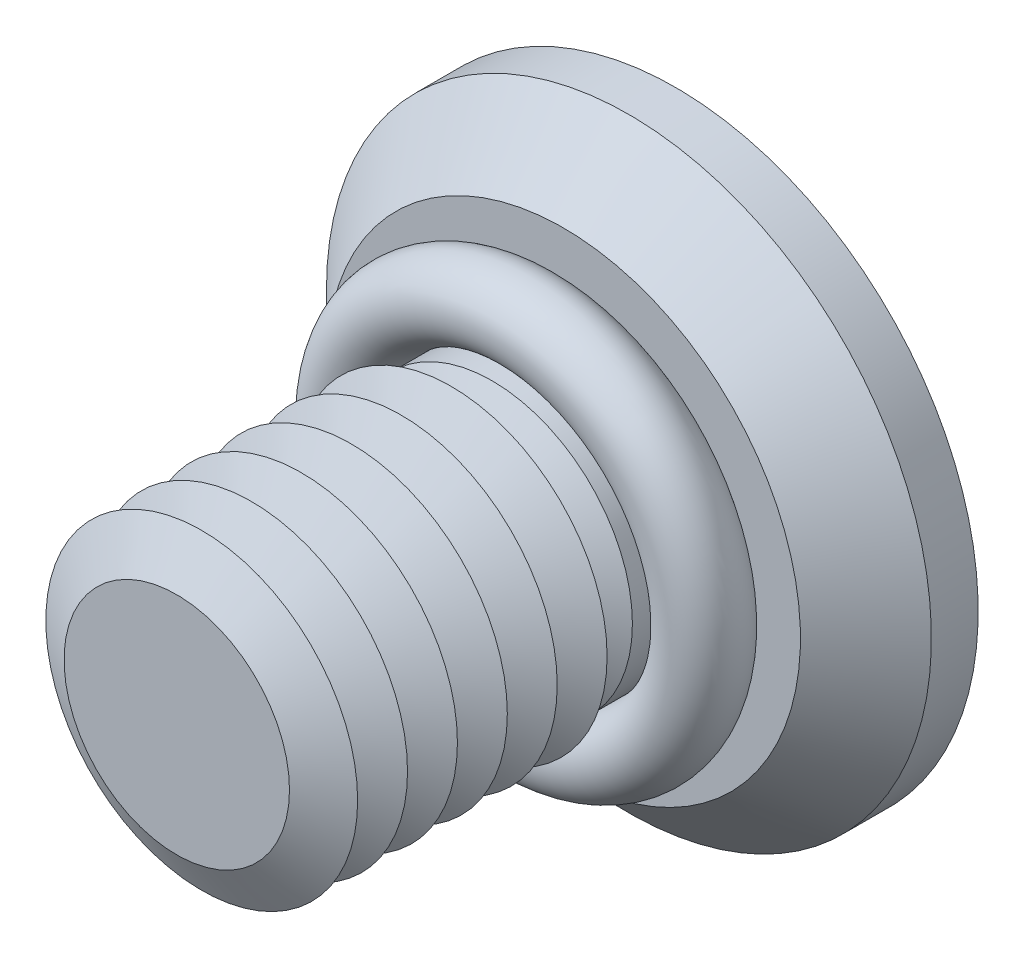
ISO-10303-21;
HEADER;
FILE_DESCRIPTION(('STEP AP214'),'2;1');
FILE_NAME('part.step','',(''),(''),'','','');
FILE_SCHEMA(('AUTOMOTIVE_DESIGN { 1 0 10303 214 1 1 1 1 }'));
ENDSEC;
DATA;
#1=APPLICATION_CONTEXT('core data for automotive mechanical design processes');
#2=APPLICATION_PROTOCOL_DEFINITION('international standard','automotive_design',2000,#1);
#3=PRODUCT_CONTEXT('',#1,'mechanical');
#4=PRODUCT('Part','Part','',(#3));
#5=PRODUCT_RELATED_PRODUCT_CATEGORY('part','',(#4));
#6=PRODUCT_DEFINITION_FORMATION('','',#4);
#7=PRODUCT_DEFINITION_CONTEXT('part definition',#1,'design');
#8=PRODUCT_DEFINITION('design','',#6,#7);
#9=PRODUCT_DEFINITION_SHAPE('','',#8);
#10=(LENGTH_UNIT() NAMED_UNIT(*) SI_UNIT(.MILLI.,.METRE.));
#11=(NAMED_UNIT(*) PLANE_ANGLE_UNIT() SI_UNIT($,.RADIAN.));
#12=(NAMED_UNIT(*) SI_UNIT($,.STERADIAN.) SOLID_ANGLE_UNIT());
#13=UNCERTAINTY_MEASURE_WITH_UNIT(LENGTH_MEASURE(1.E-05),#10,'distance_accuracy_value','');
#14=(GEOMETRIC_REPRESENTATION_CONTEXT(3) GLOBAL_UNCERTAINTY_ASSIGNED_CONTEXT((#13)) GLOBAL_UNIT_ASSIGNED_CONTEXT((#10,
#11,#12)) REPRESENTATION_CONTEXT('',''));
#15=CARTESIAN_POINT('',(0.,0.,0.));
#16=DIRECTION('',(0.,0.,1.));
#17=DIRECTION('',(1.,0.,0.));
#18=AXIS2_PLACEMENT_3D('',#15,#16,#17);
#19=CARTESIAN_POINT('',(0.,0.,2.4));
#20=DIRECTION('',(0.,0.,1.));
#21=DIRECTION('',(1.,0.,0.));
#22=AXIS2_PLACEMENT_3D('',#19,#20,#21);
#23=TOROIDAL_SURFACE('',#22,2.85,0.6);
#24=CARTESIAN_POINT('',(0.,2.85,2.4));
#25=DIRECTION('',(1.,0.,0.));
#26=DIRECTION('',(0.,0.,-1.));
#27=AXIS2_PLACEMENT_3D('',#24,#25,#26);
#28=CIRCLE('',#27,0.6);
#29=CARTESIAN_POINT('',(0.,3.45,2.4));
#30=VERTEX_POINT('',#29);
#31=EDGE_CURVE('P0_E10',#30,#30,#28,.T.);
#32=CARTESIAN_POINT('',(0.,0.,2.4));
#33=DIRECTION('',(0.,0.,1.));
#34=DIRECTION('',(1.,0.,0.));
#35=AXIS2_PLACEMENT_3D('',#32,#33,#34);
#36=CIRCLE('',#35,3.45);
#37=EDGE_CURVE('',#30,#30,#36,.T.);
#38=ORIENTED_EDGE('',*,*,#31,.F.);
#39=ORIENTED_EDGE('',*,*,#31,.T.);
#40=ORIENTED_EDGE('',*,*,#37,.T.);
#41=ORIENTED_EDGE('',*,*,#37,.F.);
#42=EDGE_LOOP('',(#38,#40,#39,#41));
#43=FACE_BOUND('',#42,.T.);
#44=ADVANCED_FACE('P0_F14',(#43),#23,.T.);
#45=CLOSED_SHELL('',(#44));
#46=MANIFOLD_SOLID_BREP('P0_B1',#45);
#47=CARTESIAN_POINT('',(0.,0.,4.));
#48=DIRECTION('',(0.,0.,-1.));
#49=DIRECTION('',(-1.,0.,0.));
#50=AXIS2_PLACEMENT_3D('',#47,#48,#49);
#51=CONICAL_SURFACE('',#50,1.80717967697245,1.0471975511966);
#52=CARTESIAN_POINT('',(0.,0.,3.6));
#53=DIRECTION('',(0.,0.,1.));
#54=DIRECTION('',(1.,0.,0.));
#55=AXIS2_PLACEMENT_3D('',#52,#53,#54);
#56=CIRCLE('',#55,2.5);
#57=CARTESIAN_POINT('',(2.5,0.,3.6));
#58=VERTEX_POINT('',#57);
#59=EDGE_CURVE('P1_E324',#58,#58,#56,.T.);
#60=ORIENTED_EDGE('',*,*,#59,.T.);
#61=EDGE_LOOP('',(#60));
#62=FACE_BOUND('',#61,.T.);
#63=CARTESIAN_POINT('',(0.,0.,4.));
#64=DIRECTION('',(0.,0.,1.));
#65=DIRECTION('',(1.,0.,0.));
#66=AXIS2_PLACEMENT_3D('',#63,#64,#65);
#67=CIRCLE('',#66,1.80717967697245);
#68=CARTESIAN_POINT('',(1.80717967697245,0.,4.));
#69=VERTEX_POINT('',#68);
#70=EDGE_CURVE('P1_E321',#69,#69,#67,.T.);
#71=ORIENTED_EDGE('',*,*,#70,.F.);
#72=EDGE_LOOP('',(#71));
#73=FACE_BOUND('',#72,.T.);
#74=ADVANCED_FACE('P1_F15',(#62,#73),#51,.T.);
#75=CARTESIAN_POINT('',(0.,0.,4.4));
#76=DIRECTION('',(0.,0.,1.));
#77=DIRECTION('',(1.,0.,0.));
#78=AXIS2_PLACEMENT_3D('',#75,#76,#77);
#79=CONICAL_SURFACE('',#78,2.5,1.0471975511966);
#80=ORIENTED_EDGE('',*,*,#70,.T.);
#81=EDGE_LOOP('',(#80));
#82=FACE_BOUND('',#81,.T.);
#83=CARTESIAN_POINT('',(0.,0.,4.4));
#84=DIRECTION('',(0.,0.,1.));
#85=DIRECTION('',(1.,0.,0.));
#86=AXIS2_PLACEMENT_3D('',#83,#84,#85);
#87=CIRCLE('',#86,2.5);
#88=CARTESIAN_POINT('',(2.5,0.,4.4));
#89=VERTEX_POINT('',#88);
#90=EDGE_CURVE('P1_E318',#89,#89,#87,.T.);
#91=ORIENTED_EDGE('',*,*,#90,.F.);
#92=EDGE_LOOP('',(#91));
#93=FACE_BOUND('',#92,.T.);
#94=ADVANCED_FACE('P1_F245',(#82,#93),#79,.T.);
#95=CARTESIAN_POINT('',(0.,0.,8.));
#96=DIRECTION('',(0.,0.,1.));
#97=DIRECTION('',(1.,0.,0.));
#98=AXIS2_PLACEMENT_3D('',#95,#96,#97);
#99=PLANE('',#98);
#100=CARTESIAN_POINT('',(0.,0.,8.));
#101=DIRECTION('',(0.,0.,1.));
#102=DIRECTION('',(1.,0.,0.));
#103=AXIS2_PLACEMENT_3D('',#100,#101,#102);
#104=CIRCLE('',#103,1.80717967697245);
#105=CARTESIAN_POINT('',(1.80717967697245,0.,8.));
#106=VERTEX_POINT('',#105);
#107=EDGE_CURVE('P1_E131',#106,#106,#104,.T.);
#108=ORIENTED_EDGE('',*,*,#107,.T.);
#109=EDGE_LOOP('',(#108));
#110=FACE_BOUND('',#109,.T.);
#111=ADVANCED_FACE('P1_F251',(#110),#99,.T.);
#112=CARTESIAN_POINT('',(0.,0.,8.));
#113=DIRECTION('',(0.,0.,-1.));
#114=DIRECTION('',(-1.,0.,0.));
#115=AXIS2_PLACEMENT_3D('',#112,#113,#114);
#116=CONICAL_SURFACE('',#115,1.80717967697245,1.0471975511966);
#117=CARTESIAN_POINT('',(0.,0.,7.6));
#118=DIRECTION('',(0.,0.,1.));
#119=DIRECTION('',(1.,0.,0.));
#120=AXIS2_PLACEMENT_3D('',#117,#118,#119);
#121=CIRCLE('',#120,2.5);
#122=CARTESIAN_POINT('',(2.5,0.,7.6));
#123=VERTEX_POINT('',#122);
#124=EDGE_CURVE('P1_E133',#123,#123,#121,.T.);
#125=ORIENTED_EDGE('',*,*,#124,.T.);
#126=EDGE_LOOP('',(#125));
#127=FACE_BOUND('',#126,.T.);
#128=ORIENTED_EDGE('',*,*,#107,.F.);
#129=EDGE_LOOP('',(#128));
#130=FACE_BOUND('',#129,.T.);
#131=ADVANCED_FACE('P1_F196',(#127,#130),#116,.T.);
#132=CARTESIAN_POINT('',(0.,0.,7.6));
#133=DIRECTION('',(0.,0.,1.));
#134=DIRECTION('',(1.,0.,0.));
#135=AXIS2_PLACEMENT_3D('',#132,#133,#134);
#136=CONICAL_SURFACE('',#135,2.5,1.0471975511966);
#137=CARTESIAN_POINT('',(0.,0.,7.2));
#138=DIRECTION('',(0.,0.,1.));
#139=DIRECTION('',(1.,0.,0.));
#140=AXIS2_PLACEMENT_3D('',#137,#138,#139);
#141=CIRCLE('',#140,1.80717967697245);
#142=CARTESIAN_POINT('',(1.80717967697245,0.,7.2));
#143=VERTEX_POINT('',#142);
#144=EDGE_CURVE('P1_E297',#143,#143,#141,.T.);
#145=ORIENTED_EDGE('',*,*,#144,.T.);
#146=EDGE_LOOP('',(#145));
#147=FACE_BOUND('',#146,.T.);
#148=ORIENTED_EDGE('',*,*,#124,.F.);
#149=EDGE_LOOP('',(#148));
#150=FACE_BOUND('',#149,.T.);
#151=ADVANCED_FACE('P1_F284',(#147,#150),#136,.T.);
#152=CARTESIAN_POINT('',(0.,0.,7.2));
#153=DIRECTION('',(0.,0.,-1.));
#154=DIRECTION('',(-1.,0.,0.));
#155=AXIS2_PLACEMENT_3D('',#152,#153,#154);
#156=CONICAL_SURFACE('',#155,1.80717967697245,1.0471975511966);
#157=CARTESIAN_POINT('',(0.,0.,6.8));
#158=DIRECTION('',(0.,0.,1.));
#159=DIRECTION('',(1.,0.,0.));
#160=AXIS2_PLACEMENT_3D('',#157,#158,#159);
#161=CIRCLE('',#160,2.5);
#162=CARTESIAN_POINT('',(2.5,0.,6.8));
#163=VERTEX_POINT('',#162);
#164=EDGE_CURVE('P1_E294',#163,#163,#161,.T.);
#165=ORIENTED_EDGE('',*,*,#164,.T.);
#166=EDGE_LOOP('',(#165));
#167=FACE_BOUND('',#166,.T.);
#168=ORIENTED_EDGE('',*,*,#144,.F.);
#169=EDGE_LOOP('',(#168));
#170=FACE_BOUND('',#169,.T.);
#171=ADVANCED_FACE('P1_F279',(#167,#170),#156,.T.);
#172=CARTESIAN_POINT('',(0.,0.,6.8));
#173=DIRECTION('',(0.,0.,1.));
#174=DIRECTION('',(1.,0.,0.));
#175=AXIS2_PLACEMENT_3D('',#172,#173,#174);
#176=CONICAL_SURFACE('',#175,2.5,1.0471975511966);
#177=CARTESIAN_POINT('',(0.,0.,6.4));
#178=DIRECTION('',(0.,0.,1.));
#179=DIRECTION('',(1.,0.,0.));
#180=AXIS2_PLACEMENT_3D('',#177,#178,#179);
#181=CIRCLE('',#180,1.80717967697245);
#182=CARTESIAN_POINT('',(1.80717967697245,0.,6.4));
#183=VERTEX_POINT('',#182);
#184=EDGE_CURVE('P1_E301',#183,#183,#181,.T.);
#185=ORIENTED_EDGE('',*,*,#184,.T.);
#186=EDGE_LOOP('',(#185));
#187=FACE_BOUND('',#186,.T.);
#188=ORIENTED_EDGE('',*,*,#164,.F.);
#189=EDGE_LOOP('',(#188));
#190=FACE_BOUND('',#189,.T.);
#191=ADVANCED_FACE('P1_F276',(#187,#190),#176,.T.);
#192=CARTESIAN_POINT('',(0.,0.,6.4));
#193=DIRECTION('',(0.,0.,-1.));
#194=DIRECTION('',(-1.,0.,0.));
#195=AXIS2_PLACEMENT_3D('',#192,#193,#194);
#196=CONICAL_SURFACE('',#195,1.80717967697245,1.0471975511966);
#197=CARTESIAN_POINT('',(0.,0.,6.));
#198=DIRECTION('',(0.,0.,1.));
#199=DIRECTION('',(1.,0.,0.));
#200=AXIS2_PLACEMENT_3D('',#197,#198,#199);
#201=CIRCLE('',#200,2.5);
#202=CARTESIAN_POINT('',(2.5,0.,6.));
#203=VERTEX_POINT('',#202);
#204=EDGE_CURVE('P1_E306',#203,#203,#201,.T.);
#205=ORIENTED_EDGE('',*,*,#204,.T.);
#206=EDGE_LOOP('',(#205));
#207=FACE_BOUND('',#206,.T.);
#208=ORIENTED_EDGE('',*,*,#184,.F.);
#209=EDGE_LOOP('',(#208));
#210=FACE_BOUND('',#209,.T.);
#211=ADVANCED_FACE('P1_F271',(#207,#210),#196,.T.);
#212=CARTESIAN_POINT('',(0.,0.,6.));
#213=DIRECTION('',(0.,0.,1.));
#214=DIRECTION('',(1.,0.,0.));
#215=AXIS2_PLACEMENT_3D('',#212,#213,#214);
#216=CONICAL_SURFACE('',#215,2.5,1.0471975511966);
#217=CARTESIAN_POINT('',(0.,0.,5.6));
#218=DIRECTION('',(0.,0.,1.));
#219=DIRECTION('',(1.,0.,0.));
#220=AXIS2_PLACEMENT_3D('',#217,#218,#219);
#221=CIRCLE('',#220,1.80717967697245);
#222=CARTESIAN_POINT('',(1.80717967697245,0.,5.6));
#223=VERTEX_POINT('',#222);
#224=EDGE_CURVE('P1_E309',#223,#223,#221,.T.);
#225=ORIENTED_EDGE('',*,*,#224,.T.);
#226=EDGE_LOOP('',(#225));
#227=FACE_BOUND('',#226,.T.);
#228=ORIENTED_EDGE('',*,*,#204,.F.);
#229=EDGE_LOOP('',(#228));
#230=FACE_BOUND('',#229,.T.);
#231=ADVANCED_FACE('P1_F268',(#227,#230),#216,.T.);
#232=CARTESIAN_POINT('',(0.,0.,5.6));
#233=DIRECTION('',(0.,0.,-1.));
#234=DIRECTION('',(-1.,0.,0.));
#235=AXIS2_PLACEMENT_3D('',#232,#233,#234);
#236=CONICAL_SURFACE('',#235,1.80717967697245,1.0471975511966);
#237=CARTESIAN_POINT('',(0.,0.,5.2));
#238=DIRECTION('',(0.,0.,1.));
#239=DIRECTION('',(1.,0.,0.));
#240=AXIS2_PLACEMENT_3D('',#237,#238,#239);
#241=CIRCLE('',#240,2.5);
#242=CARTESIAN_POINT('',(2.5,0.,5.2));
#243=VERTEX_POINT('',#242);
#244=EDGE_CURVE('P1_E312',#243,#243,#241,.T.);
#245=ORIENTED_EDGE('',*,*,#244,.T.);
#246=EDGE_LOOP('',(#245));
#247=FACE_BOUND('',#246,.T.);
#248=ORIENTED_EDGE('',*,*,#224,.F.);
#249=EDGE_LOOP('',(#248));
#250=FACE_BOUND('',#249,.T.);
#251=ADVANCED_FACE('P1_F262',(#247,#250),#236,.T.);
#252=CARTESIAN_POINT('',(0.,0.,5.2));
#253=DIRECTION('',(0.,0.,1.));
#254=DIRECTION('',(1.,0.,0.));
#255=AXIS2_PLACEMENT_3D('',#252,#253,#254);
#256=CONICAL_SURFACE('',#255,2.5,1.0471975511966);
#257=CARTESIAN_POINT('',(0.,0.,4.8));
#258=DIRECTION('',(0.,0.,1.));
#259=DIRECTION('',(1.,0.,0.));
#260=AXIS2_PLACEMENT_3D('',#257,#258,#259);
#261=CIRCLE('',#260,1.80717967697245);
#262=CARTESIAN_POINT('',(1.80717967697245,0.,4.8));
#263=VERTEX_POINT('',#262);
#264=EDGE_CURVE('P1_E315',#263,#263,#261,.T.);
#265=ORIENTED_EDGE('',*,*,#264,.T.);
#266=EDGE_LOOP('',(#265));
#267=FACE_BOUND('',#266,.T.);
#268=ORIENTED_EDGE('',*,*,#244,.F.);
#269=EDGE_LOOP('',(#268));
#270=FACE_BOUND('',#269,.T.);
#271=ADVANCED_FACE('P1_F258',(#267,#270),#256,.T.);
#272=CARTESIAN_POINT('',(0.,0.,4.8));
#273=DIRECTION('',(0.,0.,-1.));
#274=DIRECTION('',(-1.,0.,0.));
#275=AXIS2_PLACEMENT_3D('',#272,#273,#274);
#276=CONICAL_SURFACE('',#275,1.80717967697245,1.0471975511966);
#277=ORIENTED_EDGE('',*,*,#90,.T.);
#278=EDGE_LOOP('',(#277));
#279=FACE_BOUND('',#278,.T.);
#280=ORIENTED_EDGE('',*,*,#264,.F.);
#281=EDGE_LOOP('',(#280));
#282=FACE_BOUND('',#281,.T.);
#283=ADVANCED_FACE('P1_F261',(#279,#282),#276,.T.);
#284=CARTESIAN_POINT('',(0.,0.,3.2));
#285=DIRECTION('',(0.,0.,-1.));
#286=DIRECTION('',(-1.,0.,0.));
#287=AXIS2_PLACEMENT_3D('',#284,#285,#286);
#288=CONICAL_SURFACE('',#287,1.80717967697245,1.0471975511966);
#289=CARTESIAN_POINT('',(0.,0.,3.2));
#290=DIRECTION('',(0.,0.,1.));
#291=DIRECTION('',(1.,0.,0.));
#292=AXIS2_PLACEMENT_3D('',#289,#290,#291);
#293=CIRCLE('',#292,1.80717967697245);
#294=CARTESIAN_POINT('',(1.80717967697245,0.,3.2));
#295=VERTEX_POINT('',#294);
#296=EDGE_CURVE('P1_E326',#295,#295,#293,.T.);
#297=ORIENTED_EDGE('',*,*,#296,.F.);
#298=EDGE_LOOP('',(#297));
#299=FACE_BOUND('',#298,.T.);
#300=CARTESIAN_POINT('',(0.,0.,2.9443375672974));
#301=DIRECTION('',(0.,0.,-1.));
#302=DIRECTION('',(-1.,0.,0.));
#303=AXIS2_PLACEMENT_3D('',#300,#301,#302);
#304=CIRCLE('',#303,2.25);
#305=CARTESIAN_POINT('',(-2.25,0.,2.9443375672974));
#306=VERTEX_POINT('',#305);
#307=EDGE_CURVE('P1_E19',#306,#306,#304,.F.);
#308=ORIENTED_EDGE('',*,*,#307,.T.);
#309=EDGE_LOOP('',(#308));
#310=FACE_BOUND('',#309,.T.);
#311=ADVANCED_FACE('P1_F266',(#299,#310),#288,.T.);
#312=CARTESIAN_POINT('',(0.,0.,3.6));
#313=DIRECTION('',(0.,0.,1.));
#314=DIRECTION('',(1.,0.,0.));
#315=AXIS2_PLACEMENT_3D('',#312,#313,#314);
#316=CONICAL_SURFACE('',#315,2.5,1.0471975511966);
#317=ORIENTED_EDGE('',*,*,#296,.T.);
#318=EDGE_LOOP('',(#317));
#319=FACE_BOUND('',#318,.T.);
#320=ORIENTED_EDGE('',*,*,#59,.F.);
#321=EDGE_LOOP('',(#320));
#322=FACE_BOUND('',#321,.T.);
#323=ADVANCED_FACE('P1_F330',(#319,#322),#316,.T.);
#324=CARTESIAN_POINT('',(0.,0.,2.));
#325=DIRECTION('',(0.,0.,-1.));
#326=DIRECTION('',(-1.,0.,0.));
#327=AXIS2_PLACEMENT_3D('',#324,#325,#326);
#328=CONICAL_SURFACE('',#327,1.5,1.0471975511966);
#329=CARTESIAN_POINT('',(0.,0.,2.86602540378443));
#330=VERTEX_POINT('',#329);
#331=VERTEX_LOOP('',#330);
#332=FACE_BOUND('',#331,.T.);
#333=CARTESIAN_POINT('',(0.,0.,2.));
#334=DIRECTION('',(0.,0.,-1.));
#335=DIRECTION('',(-1.,0.,0.));
#336=AXIS2_PLACEMENT_3D('',#333,#334,#335);
#337=CIRCLE('',#336,1.5);
#338=CARTESIAN_POINT('',(-1.5,0.,2.));
#339=VERTEX_POINT('',#338);
#340=CARTESIAN_POINT('',(-0.75,1.29903810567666,2.));
#341=VERTEX_POINT('',#340);
#342=EDGE_CURVE('P1_E117',#339,#341,#337,.T.);
#343=ORIENTED_EDGE('',*,*,#342,.T.);
#344=CARTESIAN_POINT('',(0.,0.,2.));
#345=DIRECTION('',(0.,0.,-1.));
#346=DIRECTION('',(-1.,0.,0.));
#347=AXIS2_PLACEMENT_3D('',#344,#345,#346);
#348=CIRCLE('',#347,1.5);
#349=CARTESIAN_POINT('',(0.75,1.29903810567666,2.));
#350=VERTEX_POINT('',#349);
#351=EDGE_CURVE('P1_E24',#341,#350,#348,.T.);
#352=ORIENTED_EDGE('',*,*,#351,.T.);
#353=CARTESIAN_POINT('',(1.5,0.,2.));
#354=VERTEX_POINT('',#353);
#355=EDGE_CURVE('P1_E635',#350,#354,#348,.T.);
#356=ORIENTED_EDGE('',*,*,#355,.T.);
#357=CARTESIAN_POINT('',(0.750000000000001,-1.29903810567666,2.));
#358=VERTEX_POINT('',#357);
#359=EDGE_CURVE('P1_E628',#354,#358,#348,.T.);
#360=ORIENTED_EDGE('',*,*,#359,.T.);
#361=CARTESIAN_POINT('',(-0.75,-1.29903810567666,2.));
#362=VERTEX_POINT('',#361);
#363=EDGE_CURVE('P1_E182',#358,#362,#348,.T.);
#364=ORIENTED_EDGE('',*,*,#363,.T.);
#365=EDGE_CURVE('P1_E179',#362,#339,#348,.T.);
#366=ORIENTED_EDGE('',*,*,#365,.T.);
#367=EDGE_LOOP('',(#343,#352,#356,#360,#364,#366));
#368=FACE_BOUND('',#367,.T.);
#369=ADVANCED_FACE('P1_F198',(#332,#368),#328,.F.);
#370=CARTESIAN_POINT('',(0.,0.,2.));
#371=DIRECTION('',(0.,0.,-1.));
#372=DIRECTION('',(-1.,0.,0.));
#373=AXIS2_PLACEMENT_3D('',#370,#371,#372);
#374=PLANE('',#373);
#375=ORIENTED_EDGE('',*,*,#363,.F.);
#376=DIRECTION('',(-0.866025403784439,-0.5,0.));
#377=VECTOR('',#376,1.);
#378=CARTESIAN_POINT('',(1.5,-0.866025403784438,2.));
#379=LINE('',#378,#377);
#380=CARTESIAN_POINT('',(0.,-1.73205080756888,2.));
#381=VERTEX_POINT('',#380);
#382=EDGE_CURVE('P1_E644',#358,#381,#379,.T.);
#383=ORIENTED_EDGE('',*,*,#382,.T.);
#384=DIRECTION('',(-0.866025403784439,0.5,0.));
#385=VECTOR('',#384,1.);
#386=CARTESIAN_POINT('',(0.,-1.73205080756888,2.));
#387=LINE('',#386,#385);
#388=EDGE_CURVE('P1_E651',#381,#362,#387,.T.);
#389=ORIENTED_EDGE('',*,*,#388,.T.);
#390=EDGE_LOOP('',(#375,#383,#389));
#391=FACE_BOUND('',#390,.T.);
#392=ADVANCED_FACE('P1_F442',(#391),#374,.T.);
#393=ORIENTED_EDGE('',*,*,#365,.F.);
#394=CARTESIAN_POINT('',(-1.5,-0.86602540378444,2.));
#395=VERTEX_POINT('',#394);
#396=EDGE_CURVE('P1_E654',#362,#395,#387,.T.);
#397=ORIENTED_EDGE('',*,*,#396,.T.);
#398=DIRECTION('',(0.,1.,0.));
#399=VECTOR('',#398,1.);
#400=CARTESIAN_POINT('',(-1.5,-0.86602540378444,2.));
#401=LINE('',#400,#399);
#402=EDGE_CURVE('P1_E123',#395,#339,#401,.T.);
#403=ORIENTED_EDGE('',*,*,#402,.T.);
#404=EDGE_LOOP('',(#393,#397,#403));
#405=FACE_BOUND('',#404,.T.);
#406=ADVANCED_FACE('P1_F231',(#405),#374,.T.);
#407=ORIENTED_EDGE('',*,*,#342,.F.);
#408=CARTESIAN_POINT('',(-1.5,0.866025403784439,2.));
#409=VERTEX_POINT('',#408);
#410=EDGE_CURVE('P1_E656',#339,#409,#401,.T.);
#411=ORIENTED_EDGE('',*,*,#410,.T.);
#412=DIRECTION('',(0.866025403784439,0.5,0.));
#413=VECTOR('',#412,1.);
#414=CARTESIAN_POINT('',(-1.5,0.866025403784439,2.));
#415=LINE('',#414,#413);
#416=EDGE_CURVE('P1_E659',#409,#341,#415,.T.);
#417=ORIENTED_EDGE('',*,*,#416,.T.);
#418=EDGE_LOOP('',(#407,#411,#417));
#419=FACE_BOUND('',#418,.T.);
#420=ADVANCED_FACE('P1_F459',(#419),#374,.T.);
#421=ORIENTED_EDGE('',*,*,#351,.F.);
#422=CARTESIAN_POINT('',(0.,1.73205080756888,2.));
#423=VERTEX_POINT('',#422);
#424=EDGE_CURVE('P1_E658',#341,#423,#415,.T.);
#425=ORIENTED_EDGE('',*,*,#424,.T.);
#426=DIRECTION('',(0.866025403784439,-0.5,0.));
#427=VECTOR('',#426,1.);
#428=CARTESIAN_POINT('',(0.,1.73205080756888,2.));
#429=LINE('',#428,#427);
#430=EDGE_CURVE('P1_E161',#423,#350,#429,.T.);
#431=ORIENTED_EDGE('',*,*,#430,.T.);
#432=EDGE_LOOP('',(#421,#425,#431));
#433=FACE_BOUND('',#432,.T.);
#434=ADVANCED_FACE('P1_F468',(#433),#374,.T.);
#435=ORIENTED_EDGE('',*,*,#355,.F.);
#436=CARTESIAN_POINT('',(1.5,0.866025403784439,2.));
#437=VERTEX_POINT('',#436);
#438=EDGE_CURVE('P1_E643',#350,#437,#429,.T.);
#439=ORIENTED_EDGE('',*,*,#438,.T.);
#440=DIRECTION('',(0.,-1.,0.));
#441=VECTOR('',#440,1.);
#442=CARTESIAN_POINT('',(1.5,0.866025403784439,2.));
#443=LINE('',#442,#441);
#444=EDGE_CURVE('P1_E638',#437,#354,#443,.T.);
#445=ORIENTED_EDGE('',*,*,#444,.T.);
#446=EDGE_LOOP('',(#435,#439,#445));
#447=FACE_BOUND('',#446,.T.);
#448=ADVANCED_FACE('P1_F477',(#447),#374,.T.);
#449=ORIENTED_EDGE('',*,*,#359,.F.);
#450=CARTESIAN_POINT('',(1.5,-0.866025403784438,2.));
#451=VERTEX_POINT('',#450);
#452=EDGE_CURVE('P1_E630',#354,#451,#443,.T.);
#453=ORIENTED_EDGE('',*,*,#452,.T.);
#454=EDGE_CURVE('P1_E125',#451,#358,#379,.T.);
#455=ORIENTED_EDGE('',*,*,#454,.T.);
#456=EDGE_LOOP('',(#449,#453,#455));
#457=FACE_BOUND('',#456,.T.);
#458=ADVANCED_FACE('P1_F229',(#457),#374,.T.);
#459=CARTESIAN_POINT('',(1.5,-0.866025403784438,2.));
#460=DIRECTION('',(0.5,-0.866025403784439,0.));
#461=DIRECTION('',(0.866025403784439,0.5,0.));
#462=AXIS2_PLACEMENT_3D('',#459,#460,#461);
#463=PLANE('',#462);
#464=DIRECTION('',(0.,0.,-1.));
#465=VECTOR('',#464,1.);
#466=CARTESIAN_POINT('',(1.5,-0.866025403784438,2.));
#467=LINE('',#466,#465);
#468=CARTESIAN_POINT('',(1.5,-0.866025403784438,0.));
#469=VERTEX_POINT('',#468);
#470=EDGE_CURVE('P1_E164',#451,#469,#467,.T.);
#471=ORIENTED_EDGE('',*,*,#470,.T.);
#472=CARTESIAN_POINT('',(1.5002,-0.865909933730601,-3.09432014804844E-05));
#473=CARTESIAN_POINT('',(1.43789222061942,-0.901883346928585,0.00961367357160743));
#474=CARTESIAN_POINT('',(1.37547144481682,-0.937921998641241,0.0183695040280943));
#475=CARTESIAN_POINT('',(1.25040937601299,-1.01012661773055,0.0337528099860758));
#476=CARTESIAN_POINT('',(1.18776800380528,-1.04629263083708,0.0403794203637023));
#477=CARTESIAN_POINT('',(1.06264466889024,-1.11853262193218,0.0511173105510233));
#478=CARTESIAN_POINT('',(1.00016355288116,-1.15460611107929,0.0552413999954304));
#479=CARTESIAN_POINT('',(0.875121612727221,-1.22679910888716,0.0607713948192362));
#480=CARTESIAN_POINT('',(0.812560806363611,-1.26291860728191,0.0621778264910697));
#481=CARTESIAN_POINT('',(0.68743919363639,-1.33515760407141,0.0621778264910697));
#482=CARTESIAN_POINT('',(0.62487838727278,-1.37127710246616,0.0607713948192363));
#483=CARTESIAN_POINT('',(0.49983644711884,-1.44347010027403,0.0552413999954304));
#484=CARTESIAN_POINT('',(0.437355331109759,-1.47954358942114,0.0511173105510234));
#485=CARTESIAN_POINT('',(0.312231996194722,-1.55178358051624,0.0403794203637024));
#486=CARTESIAN_POINT('',(0.249590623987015,-1.58794959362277,0.0337528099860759));
#487=CARTESIAN_POINT('',(0.124528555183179,-1.66015421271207,0.0183695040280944));
#488=CARTESIAN_POINT('',(0.0621077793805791,-1.69619286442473,0.00961367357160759));
#489=CARTESIAN_POINT('',(-0.000199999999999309,-1.73216627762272,-3.09432014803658E-05));
#490=B_SPLINE_CURVE_WITH_KNOTS('',3,(#472,#473,#474,#475,#476,#477,#478,#479,#480,#481,#482,
#483,#484,#485,#486,#487,#488,#489),.UNSPECIFIED.,.F.,.F.,(4,2,2,2,2,2,2,2,4),(0.,
0.217782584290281,0.435653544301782,0.652399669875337,0.869103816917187,1.08580796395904,
1.30255408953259,1.52042504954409,1.73820763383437),.UNSPECIFIED.);
#491=CARTESIAN_POINT('',(0.,-1.73205080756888,0.));
#492=VERTEX_POINT('',#491);
#493=EDGE_CURVE('P1_E118',#469,#492,#490,.T.);
#494=ORIENTED_EDGE('',*,*,#493,.T.);
#495=DIRECTION('',(0.,0.,-1.));
#496=VECTOR('',#495,1.);
#497=CARTESIAN_POINT('',(0.,-1.73205080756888,2.));
#498=LINE('',#497,#496);
#499=EDGE_CURVE('P1_E116',#381,#492,#498,.T.);
#500=ORIENTED_EDGE('',*,*,#499,.F.);
#501=ORIENTED_EDGE('',*,*,#382,.F.);
#502=ORIENTED_EDGE('',*,*,#454,.F.);
#503=EDGE_LOOP('',(#471,#494,#500,#501,#502));
#504=FACE_BOUND('',#503,.T.);
#505=ADVANCED_FACE('P1_F226',(#504),#463,.F.);
#506=CARTESIAN_POINT('',(0.,-1.73205080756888,2.));
#507=DIRECTION('',(-0.5,-0.866025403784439,0.));
#508=DIRECTION('',(0.866025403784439,-0.5,0.));
#509=AXIS2_PLACEMENT_3D('',#506,#507,#508);
#510=PLANE('',#509);
#511=ORIENTED_EDGE('',*,*,#499,.T.);
#512=CARTESIAN_POINT('',(0.000200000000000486,-1.73216627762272,-3.09432014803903E-05));
#513=CARTESIAN_POINT('',(-0.0621077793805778,-1.69619286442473,0.00961367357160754));
#514=CARTESIAN_POINT('',(-0.124528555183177,-1.66015421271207,0.0183695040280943));
#515=CARTESIAN_POINT('',(-0.249590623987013,-1.58794959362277,0.0337528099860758));
#516=CARTESIAN_POINT('',(-0.312231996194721,-1.55178358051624,0.0403794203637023));
#517=CARTESIAN_POINT('',(-0.437355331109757,-1.47954358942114,0.0511173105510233));
#518=CARTESIAN_POINT('',(-0.499836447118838,-1.44347010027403,0.0552413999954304));
#519=CARTESIAN_POINT('',(-0.624878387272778,-1.37127710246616,0.0607713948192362));
#520=CARTESIAN_POINT('',(-0.687439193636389,-1.33515760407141,0.0621778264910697));
#521=CARTESIAN_POINT('',(-0.81256080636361,-1.26291860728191,0.0621778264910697));
#522=CARTESIAN_POINT('',(-0.87512161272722,-1.22679910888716,0.0607713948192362));
#523=CARTESIAN_POINT('',(-1.00016355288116,-1.15460611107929,0.0552413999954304));
#524=CARTESIAN_POINT('',(-1.06264466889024,-1.11853262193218,0.0511173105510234));
#525=CARTESIAN_POINT('',(-1.18776800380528,-1.04629263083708,0.0403794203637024));
#526=CARTESIAN_POINT('',(-1.25040937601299,-1.01012661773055,0.0337528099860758));
#527=CARTESIAN_POINT('',(-1.37547144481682,-0.937921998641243,0.0183695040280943));
#528=CARTESIAN_POINT('',(-1.43789222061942,-0.901883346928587,0.00961367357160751));
#529=CARTESIAN_POINT('',(-1.5002,-0.865909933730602,-3.09432014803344E-05));
#530=B_SPLINE_CURVE_WITH_KNOTS('',3,(#512,#513,#514,#515,#516,#517,#518,#519,#520,#521,#522,
#523,#524,#525,#526,#527,#528,#529),.UNSPECIFIED.,.F.,.F.,(4,2,2,2,2,2,2,2,4),(0.,
0.217782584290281,0.435653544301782,0.652399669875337,0.869103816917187,1.08580796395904,
1.30255408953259,1.52042504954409,1.73820763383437),.UNSPECIFIED.);
#531=CARTESIAN_POINT('',(-1.5,-0.86602540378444,0.));
#532=VERTEX_POINT('',#531);
#533=EDGE_CURVE('P1_E94',#492,#532,#530,.T.);
#534=ORIENTED_EDGE('',*,*,#533,.T.);
#535=DIRECTION('',(0.,0.,-1.));
#536=VECTOR('',#535,1.);
#537=CARTESIAN_POINT('',(-1.5,-0.86602540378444,2.));
#538=LINE('',#537,#536);
#539=EDGE_CURVE('P1_E112',#395,#532,#538,.T.);
#540=ORIENTED_EDGE('',*,*,#539,.F.);
#541=ORIENTED_EDGE('',*,*,#396,.F.);
#542=ORIENTED_EDGE('',*,*,#388,.F.);
#543=EDGE_LOOP('',(#511,#534,#540,#541,#542));
#544=FACE_BOUND('',#543,.T.);
#545=ADVANCED_FACE('P1_F110',(#544),#510,.F.);
#546=CARTESIAN_POINT('',(-1.5,-0.86602540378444,2.));
#547=DIRECTION('',(-1.,0.,0.));
#548=DIRECTION('',(0.,-1.,0.));
#549=AXIS2_PLACEMENT_3D('',#546,#547,#548);
#550=PLANE('',#549);
#551=ORIENTED_EDGE('',*,*,#539,.T.);
#552=CARTESIAN_POINT('',(-1.5,-2.26080568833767,-0.262887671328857));
#553=CARTESIAN_POINT('',(-1.5,-2.19307335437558,-0.247767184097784));
#554=CARTESIAN_POINT('',(-1.5,-2.12529797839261,-0.232839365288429));
#555=CARTESIAN_POINT('',(-1.5,-1.989639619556,-0.203466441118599));
#556=CARTESIAN_POINT('',(-1.5,-1.92175663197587,-0.189021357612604));
#557=CARTESIAN_POINT('',(-1.5,-1.71778516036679,-0.146529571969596));
#558=CARTESIAN_POINT('',(-1.5,-1.58151166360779,-0.119357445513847));
#559=CARTESIAN_POINT('',(-1.5,-1.30947840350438,-0.0687885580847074));
#560=CARTESIAN_POINT('',(-1.5,-1.17372447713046,-0.0453610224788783));
#561=CARTESIAN_POINT('',(-1.5,-0.901404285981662,-0.0038503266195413));
#562=CARTESIAN_POINT('',(-1.5,-0.764838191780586,0.0142339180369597));
#563=CARTESIAN_POINT('',(-1.5,-0.489293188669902,0.0427079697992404));
#564=CARTESIAN_POINT('',(-1.5,-0.350304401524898,0.0530091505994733));
#565=CARTESIAN_POINT('',(-1.5,-0.141571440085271,0.0608183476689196));
#566=CARTESIAN_POINT('',(-1.5,-0.0719628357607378,0.0621480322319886));
#567=CARTESIAN_POINT('',(-1.5,0.0672555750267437,0.0622066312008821));
#568=CARTESIAN_POINT('',(-1.5,0.136865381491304,0.0609355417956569));
#569=CARTESIAN_POINT('',(-1.5,0.346114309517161,0.0532774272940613));
#570=CARTESIAN_POINT('',(-1.5,0.485619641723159,0.0430252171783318));
#571=CARTESIAN_POINT('',(-1.5,0.763829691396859,0.0143998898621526));
#572=CARTESIAN_POINT('',(-1.5,0.902533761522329,-0.0039790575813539));
#573=CARTESIAN_POINT('',(-1.5,1.18270277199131,-0.046775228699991));
#574=CARTESIAN_POINT('',(-1.5,1.32414472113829,-0.0713381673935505));
#575=CARTESIAN_POINT('',(-1.5,1.60634089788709,-0.124177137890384));
#576=CARTESIAN_POINT('',(-1.5,1.74709501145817,-0.152453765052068));
#577=CARTESIAN_POINT('',(-1.5,2.0281352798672,-0.21141289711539));
#578=CARTESIAN_POINT('',(-1.5,2.16842128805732,-0.242096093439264));
#579=CARTESIAN_POINT('',(-1.5,2.44863558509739,-0.305057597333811));
#580=CARTESIAN_POINT('',(-1.5,2.5885638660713,-0.337335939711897));
#581=CARTESIAN_POINT('',(-1.5,2.86645602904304,-0.402586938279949));
#582=CARTESIAN_POINT('',(-1.5,3.0044230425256,-0.435546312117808));
#583=CARTESIAN_POINT('',(-1.5,3.28017563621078,-0.502227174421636));
#584=CARTESIAN_POINT('',(-1.5,3.41796121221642,-0.535948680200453));
#585=CARTESIAN_POINT('',(-1.5,3.69320305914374,-0.603899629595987));
#586=CARTESIAN_POINT('',(-1.5,3.83065952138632,-0.638128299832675));
#587=CARTESIAN_POINT('',(-1.5,4.10546119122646,-0.707008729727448));
#588=CARTESIAN_POINT('',(-1.5,4.24280640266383,-0.741660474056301));
#589=CARTESIAN_POINT('',(-1.5,4.38011382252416,-0.776459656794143));
#590=B_SPLINE_CURVE_WITH_KNOTS('',3,(#552,#553,#554,#555,#556,#557,#558,#559,#560,#561,#562,
#563,#564,#565,#566,#567,#568,#569,#570,#571,#572,#573,#574,#575,#576,#577,#578,#579,#580,#581,
#582,#583,#584,#585,#586,#587,#588,#589),.UNSPECIFIED.,.F.,.F.,(4,2,2,2,2,2,2,2,2,2,2,2,2,2,2,2,
2,2,4),(0.,0.208198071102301,0.416405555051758,0.833243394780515,1.2464565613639,
1.65958581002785,2.07735129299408,2.28617008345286,2.49498917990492,2.91428402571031,
3.33388016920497,3.76448033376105,4.19514961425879,4.62594308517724,5.05674596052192,
5.48229088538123,5.90784548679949,6.33280701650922,6.75775319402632),.UNSPECIFIED.);
#591=CARTESIAN_POINT('',(-1.5,0.866025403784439,0.));
#592=VERTEX_POINT('',#591);
#593=EDGE_CURVE('P1_E10',#532,#592,#590,.T.);
#594=ORIENTED_EDGE('',*,*,#593,.T.);
#595=DIRECTION('',(0.,0.,-1.));
#596=VECTOR('',#595,1.);
#597=CARTESIAN_POINT('',(-1.5,0.866025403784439,2.));
#598=LINE('',#597,#596);
#599=EDGE_CURVE('P1_E124',#409,#592,#598,.T.);
#600=ORIENTED_EDGE('',*,*,#599,.F.);
#601=ORIENTED_EDGE('',*,*,#410,.F.);
#602=ORIENTED_EDGE('',*,*,#402,.F.);
#603=EDGE_LOOP('',(#551,#594,#600,#601,#602));
#604=FACE_BOUND('',#603,.T.);
#605=ADVANCED_FACE('P1_F120',(#604),#550,.F.);
#606=CARTESIAN_POINT('',(-1.5,0.866025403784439,2.));
#607=DIRECTION('',(-0.5,0.866025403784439,0.));
#608=DIRECTION('',(-0.866025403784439,-0.5,0.));
#609=AXIS2_PLACEMENT_3D('',#606,#607,#608);
#610=PLANE('',#609);
#611=ORIENTED_EDGE('',*,*,#599,.T.);
#612=CARTESIAN_POINT('',(-1.5002,0.865909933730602,-3.09432014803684E-05));
#613=CARTESIAN_POINT('',(-1.43789222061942,0.901883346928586,0.00961367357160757));
#614=CARTESIAN_POINT('',(-1.37547144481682,0.937921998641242,0.0183695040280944));
#615=CARTESIAN_POINT('',(-1.25040937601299,1.01012661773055,0.0337528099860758));
#616=CARTESIAN_POINT('',(-1.18776800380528,1.04629263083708,0.0403794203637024));
#617=CARTESIAN_POINT('',(-1.06264466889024,1.11853262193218,0.0511173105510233));
#618=CARTESIAN_POINT('',(-1.00016355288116,1.15460611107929,0.0552413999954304));
#619=CARTESIAN_POINT('',(-0.875121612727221,1.22679910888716,0.0607713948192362));
#620=CARTESIAN_POINT('',(-0.81256080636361,1.26291860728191,0.0621778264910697));
#621=CARTESIAN_POINT('',(-0.687439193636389,1.33515760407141,0.0621778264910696));
#622=CARTESIAN_POINT('',(-0.624878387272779,1.37127710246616,0.0607713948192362));
#623=CARTESIAN_POINT('',(-0.499836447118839,1.44347010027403,0.0552413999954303));
#624=CARTESIAN_POINT('',(-0.437355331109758,1.47954358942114,0.0511173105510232));
#625=CARTESIAN_POINT('',(-0.312231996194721,1.55178358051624,0.0403794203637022));
#626=CARTESIAN_POINT('',(-0.249590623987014,1.58794959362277,0.0337528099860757));
#627=CARTESIAN_POINT('',(-0.124528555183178,1.66015421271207,0.0183695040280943));
#628=CARTESIAN_POINT('',(-0.0621077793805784,1.69619286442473,0.00961367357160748));
#629=CARTESIAN_POINT('',(0.000199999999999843,1.73216627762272,-3.09432014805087E-05));
#630=B_SPLINE_CURVE_WITH_KNOTS('',3,(#612,#613,#614,#615,#616,#617,#618,#619,#620,#621,#622,
#623,#624,#625,#626,#627,#628,#629),.UNSPECIFIED.,.F.,.F.,(4,2,2,2,2,2,2,2,4),(0.,
0.217782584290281,0.435653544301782,0.652399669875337,0.869103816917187,1.08580796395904,
1.30255408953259,1.52042504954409,1.73820763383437),.UNSPECIFIED.);
#631=CARTESIAN_POINT('',(0.,1.73205080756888,0.));
#632=VERTEX_POINT('',#631);
#633=EDGE_CURVE('P1_E136',#592,#632,#630,.T.);
#634=ORIENTED_EDGE('',*,*,#633,.T.);
#635=DIRECTION('',(0.,0.,-1.));
#636=VECTOR('',#635,1.);
#637=CARTESIAN_POINT('',(0.,1.73205080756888,2.));
#638=LINE('',#637,#636);
#639=EDGE_CURVE('P1_E155',#423,#632,#638,.T.);
#640=ORIENTED_EDGE('',*,*,#639,.F.);
#641=ORIENTED_EDGE('',*,*,#424,.F.);
#642=ORIENTED_EDGE('',*,*,#416,.F.);
#643=EDGE_LOOP('',(#611,#634,#640,#641,#642));
#644=FACE_BOUND('',#643,.T.);
#645=ADVANCED_FACE('P1_F153',(#644),#610,.F.);
#646=CARTESIAN_POINT('',(0.,1.73205080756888,2.));
#647=DIRECTION('',(0.5,0.866025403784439,0.));
#648=DIRECTION('',(-0.866025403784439,0.5,0.));
#649=AXIS2_PLACEMENT_3D('',#646,#647,#648);
#650=PLANE('',#649);
#651=ORIENTED_EDGE('',*,*,#639,.T.);
#652=CARTESIAN_POINT('',(-0.00019999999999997,1.73216627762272,-3.09432014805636E-05));
#653=CARTESIAN_POINT('',(0.0621077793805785,1.69619286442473,0.00961367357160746));
#654=CARTESIAN_POINT('',(0.124528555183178,1.66015421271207,0.0183695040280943));
#655=CARTESIAN_POINT('',(0.249590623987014,1.58794959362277,0.0337528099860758));
#656=CARTESIAN_POINT('',(0.312231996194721,1.55178358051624,0.0403794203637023));
#657=CARTESIAN_POINT('',(0.437355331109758,1.47954358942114,0.0511173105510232));
#658=CARTESIAN_POINT('',(0.499836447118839,1.44347010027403,0.0552413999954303));
#659=CARTESIAN_POINT('',(0.624878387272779,1.37127710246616,0.0607713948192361));
#660=CARTESIAN_POINT('',(0.68743919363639,1.33515760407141,0.0621778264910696));
#661=CARTESIAN_POINT('',(0.812560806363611,1.26291860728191,0.0621778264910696));
#662=CARTESIAN_POINT('',(0.875121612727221,1.22679910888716,0.0607713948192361));
#663=CARTESIAN_POINT('',(1.00016355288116,1.15460611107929,0.0552413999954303));
#664=CARTESIAN_POINT('',(1.06264466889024,1.11853262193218,0.0511173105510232));
#665=CARTESIAN_POINT('',(1.18776800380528,1.04629263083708,0.0403794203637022));
#666=CARTESIAN_POINT('',(1.25040937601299,1.01012661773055,0.0337528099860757));
#667=CARTESIAN_POINT('',(1.37547144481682,0.937921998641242,0.0183695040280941));
#668=CARTESIAN_POINT('',(1.43789222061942,0.901883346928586,0.0096136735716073));
#669=CARTESIAN_POINT('',(1.5002,0.865909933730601,-3.09432014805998E-05));
#670=B_SPLINE_CURVE_WITH_KNOTS('',3,(#652,#653,#654,#655,#656,#657,#658,#659,#660,#661,#662,
#663,#664,#665,#666,#667,#668,#669),.UNSPECIFIED.,.F.,.F.,(4,2,2,2,2,2,2,2,4),(0.,
0.217782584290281,0.435653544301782,0.652399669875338,0.869103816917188,1.08580796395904,
1.30255408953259,1.52042504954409,1.73820763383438),.UNSPECIFIED.);
#671=CARTESIAN_POINT('',(1.5,0.866025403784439,0.));
#672=VERTEX_POINT('',#671);
#673=EDGE_CURVE('P1_E141',#632,#672,#670,.T.);
#674=ORIENTED_EDGE('',*,*,#673,.T.);
#675=DIRECTION('',(0.,0.,-1.));
#676=VECTOR('',#675,1.);
#677=CARTESIAN_POINT('',(1.5,0.866025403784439,2.));
#678=LINE('',#677,#676);
#679=EDGE_CURVE('P1_E162',#437,#672,#678,.T.);
#680=ORIENTED_EDGE('',*,*,#679,.F.);
#681=ORIENTED_EDGE('',*,*,#438,.F.);
#682=ORIENTED_EDGE('',*,*,#430,.F.);
#683=EDGE_LOOP('',(#651,#674,#680,#681,#682));
#684=FACE_BOUND('',#683,.T.);
#685=ADVANCED_FACE('P1_F158',(#684),#650,.F.);
#686=CARTESIAN_POINT('',(1.5,0.866025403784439,2.));
#687=DIRECTION('',(1.,0.,0.));
#688=DIRECTION('',(0.,0.,-1.));
#689=AXIS2_PLACEMENT_3D('',#686,#687,#688);
#690=PLANE('',#689);
#691=ORIENTED_EDGE('',*,*,#679,.T.);
#692=CARTESIAN_POINT('',(1.5,-2.26080568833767,-0.262887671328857));
#693=CARTESIAN_POINT('',(1.5,-2.19307335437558,-0.247767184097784));
#694=CARTESIAN_POINT('',(1.5,-2.12529797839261,-0.232839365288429));
#695=CARTESIAN_POINT('',(1.5,-1.989639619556,-0.203466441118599));
#696=CARTESIAN_POINT('',(1.5,-1.92175663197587,-0.189021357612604));
#697=CARTESIAN_POINT('',(1.5,-1.71778516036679,-0.146529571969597));
#698=CARTESIAN_POINT('',(1.5,-1.58151166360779,-0.119357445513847));
#699=CARTESIAN_POINT('',(1.5,-1.30947840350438,-0.0687885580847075));
#700=CARTESIAN_POINT('',(1.5,-1.17372447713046,-0.0453610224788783));
#701=CARTESIAN_POINT('',(1.5,-0.90140428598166,-0.0038503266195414));
#702=CARTESIAN_POINT('',(1.5,-0.764838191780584,0.0142339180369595));
#703=CARTESIAN_POINT('',(1.5,-0.489293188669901,0.0427079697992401));
#704=CARTESIAN_POINT('',(1.5,-0.350304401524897,0.053009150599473));
#705=CARTESIAN_POINT('',(1.5,-0.14157144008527,0.0608183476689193));
#706=CARTESIAN_POINT('',(1.5,-0.0719628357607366,0.0621480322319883));
#707=CARTESIAN_POINT('',(1.5,0.067255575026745,0.0622066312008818));
#708=CARTESIAN_POINT('',(1.5,0.136865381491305,0.0609355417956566));
#709=CARTESIAN_POINT('',(1.5,0.346114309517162,0.0532774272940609));
#710=CARTESIAN_POINT('',(1.5,0.48561964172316,0.0430252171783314));
#711=CARTESIAN_POINT('',(1.5,0.76382969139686,0.0143998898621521));
#712=CARTESIAN_POINT('',(1.5,0.902533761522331,-0.00397905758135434));
#713=CARTESIAN_POINT('',(1.5,1.18270277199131,-0.0467752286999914));
#714=CARTESIAN_POINT('',(1.5,1.32414472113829,-0.0713381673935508));
#715=CARTESIAN_POINT('',(1.5,1.60634089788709,-0.124177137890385));
#716=CARTESIAN_POINT('',(1.5,1.74709501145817,-0.152453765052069));
#717=CARTESIAN_POINT('',(1.5,2.02813527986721,-0.21141289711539));
#718=CARTESIAN_POINT('',(1.5,2.16842128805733,-0.242096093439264));
#719=CARTESIAN_POINT('',(1.5,2.44863558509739,-0.305057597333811));
#720=CARTESIAN_POINT('',(1.5,2.5885638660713,-0.337335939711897));
#721=CARTESIAN_POINT('',(1.5,2.86645602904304,-0.40258693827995));
#722=CARTESIAN_POINT('',(1.5,3.0044230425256,-0.435546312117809));
#723=CARTESIAN_POINT('',(1.5,3.28017563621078,-0.502227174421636));
#724=CARTESIAN_POINT('',(1.5,3.41796121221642,-0.535948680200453));
#725=CARTESIAN_POINT('',(1.5,3.69320305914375,-0.603899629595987));
#726=CARTESIAN_POINT('',(1.5,3.83065952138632,-0.638128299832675));
#727=CARTESIAN_POINT('',(1.5,4.10546119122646,-0.707008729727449));
#728=CARTESIAN_POINT('',(1.5,4.24280640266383,-0.741660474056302));
#729=CARTESIAN_POINT('',(1.5,4.38011382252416,-0.776459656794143));
#730=B_SPLINE_CURVE_WITH_KNOTS('',3,(#692,#693,#694,#695,#696,#697,#698,#699,#700,#701,#702,
#703,#704,#705,#706,#707,#708,#709,#710,#711,#712,#713,#714,#715,#716,#717,#718,#719,#720,#721,
#722,#723,#724,#725,#726,#727,#728,#729),.UNSPECIFIED.,.F.,.F.,(4,2,2,2,2,2,2,2,2,2,2,2,2,2,2,2,
2,2,4),(0.,0.208198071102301,0.416405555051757,0.833243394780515,1.2464565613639,
1.65958581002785,2.07735129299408,2.28617008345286,2.49498917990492,2.91428402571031,
3.33388016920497,3.76448033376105,4.19514961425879,4.62594308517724,5.05674596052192,
5.48229088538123,5.90784548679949,6.33280701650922,6.75775319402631),.UNSPECIFIED.);
#731=EDGE_CURVE('P1_E149',#672,#469,#730,.F.);
#732=ORIENTED_EDGE('',*,*,#731,.T.);
#733=ORIENTED_EDGE('',*,*,#470,.F.);
#734=ORIENTED_EDGE('',*,*,#452,.F.);
#735=ORIENTED_EDGE('',*,*,#444,.F.);
#736=EDGE_LOOP('',(#691,#732,#733,#734,#735));
#737=FACE_BOUND('',#736,.T.);
#738=ADVANCED_FACE('P1_F232',(#737),#690,.F.);
#739=CARTESIAN_POINT('',(0.,0.,0.));
#740=DIRECTION('',(0.,0.,-1.));
#741=DIRECTION('',(-1.,0.,0.));
#742=AXIS2_PLACEMENT_3D('',#739,#740,#741);
#743=CONICAL_SURFACE('',#742,1.73205080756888,1.30899693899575);
#744=CARTESIAN_POINT('',(0.,0.,0.));
#745=DIRECTION('',(0.,0.,-1.));
#746=DIRECTION('',(-1.,0.,0.));
#747=AXIS2_PLACEMENT_3D('',#744,#745,#746);
#748=CIRCLE('',#747,1.73205080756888);
#749=EDGE_CURVE('P1_E30',#469,#492,#748,.T.);
#750=ORIENTED_EDGE('',*,*,#749,.T.);
#751=ORIENTED_EDGE('',*,*,#493,.F.);
#752=EDGE_LOOP('',(#750,#751));
#753=FACE_BOUND('',#752,.T.);
#754=ADVANCED_FACE('P1_F195',(#753),#743,.F.);
#755=EDGE_CURVE('P1_E90',#492,#532,#748,.T.);
#756=ORIENTED_EDGE('',*,*,#755,.T.);
#757=ORIENTED_EDGE('',*,*,#533,.F.);
#758=EDGE_LOOP('',(#756,#757));
#759=FACE_BOUND('',#758,.T.);
#760=ADVANCED_FACE('P1_F92',(#759),#743,.F.);
#761=EDGE_CURVE('P1_E98',#532,#592,#748,.T.);
#762=ORIENTED_EDGE('',*,*,#761,.T.);
#763=ORIENTED_EDGE('',*,*,#593,.F.);
#764=EDGE_LOOP('',(#762,#763));
#765=FACE_BOUND('',#764,.T.);
#766=ADVANCED_FACE('P1_F102',(#765),#743,.F.);
#767=EDGE_CURVE('P1_E130',#592,#632,#748,.T.);
#768=ORIENTED_EDGE('',*,*,#767,.T.);
#769=ORIENTED_EDGE('',*,*,#633,.F.);
#770=EDGE_LOOP('',(#768,#769));
#771=FACE_BOUND('',#770,.T.);
#772=ADVANCED_FACE('P1_F551',(#771),#743,.F.);
#773=EDGE_CURVE('P1_E137',#632,#672,#748,.T.);
#774=ORIENTED_EDGE('',*,*,#773,.T.);
#775=ORIENTED_EDGE('',*,*,#673,.F.);
#776=EDGE_LOOP('',(#774,#775));
#777=FACE_BOUND('',#776,.T.);
#778=ADVANCED_FACE('P1_F144',(#777),#743,.F.);
#779=EDGE_CURVE('P1_E37',#672,#469,#748,.T.);
#780=ORIENTED_EDGE('',*,*,#779,.T.);
#781=ORIENTED_EDGE('',*,*,#731,.F.);
#782=EDGE_LOOP('',(#780,#781));
#783=FACE_BOUND('',#782,.T.);
#784=ADVANCED_FACE('P1_F537',(#783),#743,.F.);
#785=CARTESIAN_POINT('',(0.,0.,0.));
#786=DIRECTION('',(0.,0.,1.));
#787=DIRECTION('',(1.,0.,0.));
#788=AXIS2_PLACEMENT_3D('',#785,#786,#787);
#789=PLANE('',#788);
#790=ORIENTED_EDGE('',*,*,#779,.F.);
#791=ORIENTED_EDGE('',*,*,#773,.F.);
#792=ORIENTED_EDGE('',*,*,#767,.F.);
#793=ORIENTED_EDGE('',*,*,#761,.F.);
#794=ORIENTED_EDGE('',*,*,#755,.F.);
#795=ORIENTED_EDGE('',*,*,#749,.F.);
#796=EDGE_LOOP('',(#790,#791,#792,#793,#794,#795));
#797=FACE_BOUND('',#796,.T.);
#798=CARTESIAN_POINT('',(0.,0.,0.));
#799=DIRECTION('',(0.,0.,-1.));
#800=DIRECTION('',(-1.,0.,0.));
#801=AXIS2_PLACEMENT_3D('',#798,#799,#800);
#802=CIRCLE('',#801,4.85);
#803=CARTESIAN_POINT('',(-4.85,0.,0.));
#804=VERTEX_POINT('',#803);
#805=EDGE_CURVE('P1_E169',#804,#804,#802,.T.);
#806=ORIENTED_EDGE('',*,*,#805,.T.);
#807=EDGE_LOOP('',(#806));
#808=FACE_BOUND('',#807,.T.);
#809=ADVANCED_FACE('P1_F17',(#797,#808),#789,.F.);
#810=CARTESIAN_POINT('',(0.,0.,8.));
#811=DIRECTION('',(0.,0.,-1.));
#812=DIRECTION('',(-1.,0.,0.));
#813=AXIS2_PLACEMENT_3D('',#810,#811,#812);
#814=CYLINDRICAL_SURFACE('',#813,4.85);
#815=ORIENTED_EDGE('',*,*,#805,.F.);
#816=EDGE_LOOP('',(#815));
#817=FACE_BOUND('',#816,.T.);
#818=CARTESIAN_POINT('',(0.,0.,0.750000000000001));
#819=DIRECTION('',(0.,0.,-1.));
#820=DIRECTION('',(-1.,0.,0.));
#821=AXIS2_PLACEMENT_3D('',#818,#819,#820);
#822=CIRCLE('',#821,4.85);
#823=CARTESIAN_POINT('',(-4.85,0.,0.750000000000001));
#824=VERTEX_POINT('',#823);
#825=EDGE_CURVE('P1_E172',#824,#824,#822,.T.);
#826=ORIENTED_EDGE('',*,*,#825,.T.);
#827=EDGE_LOOP('',(#826));
#828=FACE_BOUND('',#827,.T.);
#829=ADVANCED_FACE('P1_F351',(#817,#828),#814,.T.);
#830=CARTESIAN_POINT('',(0.,0.,0.));
#831=DIRECTION('',(0.,0.,-1.));
#832=DIRECTION('',(-1.,0.,0.));
#833=AXIS2_PLACEMENT_3D('',#830,#831,#832);
#834=CONICAL_SURFACE('',#833,5.6,0.785398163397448);
#835=CARTESIAN_POINT('',(0.,0.,1.8));
#836=DIRECTION('',(0.,0.,-1.));
#837=DIRECTION('',(-1.,0.,0.));
#838=AXIS2_PLACEMENT_3D('',#835,#836,#837);
#839=CIRCLE('',#838,3.8);
#840=CARTESIAN_POINT('',(-3.8,0.,1.8));
#841=VERTEX_POINT('',#840);
#842=EDGE_CURVE('P1_E176',#841,#841,#839,.T.);
#843=ORIENTED_EDGE('',*,*,#842,.T.);
#844=EDGE_LOOP('',(#843));
#845=FACE_BOUND('',#844,.T.);
#846=ORIENTED_EDGE('',*,*,#825,.F.);
#847=EDGE_LOOP('',(#846));
#848=FACE_BOUND('',#847,.T.);
#849=ADVANCED_FACE('P1_F346',(#845,#848),#834,.T.);
#850=CARTESIAN_POINT('',(0.,2.25,1.8));
#851=DIRECTION('',(0.,0.,-1.));
#852=DIRECTION('',(-1.,0.,0.));
#853=AXIS2_PLACEMENT_3D('',#850,#851,#852);
#854=PLANE('',#853);
#855=CARTESIAN_POINT('',(0.,0.,1.8));
#856=DIRECTION('',(0.,0.,-1.));
#857=DIRECTION('',(-1.,0.,0.));
#858=AXIS2_PLACEMENT_3D('',#855,#856,#857);
#859=CIRCLE('',#858,2.25);
#860=CARTESIAN_POINT('',(-2.25,0.,1.8));
#861=VERTEX_POINT('',#860);
#862=EDGE_CURVE('P1_E173',#861,#861,#859,.T.);
#863=ORIENTED_EDGE('',*,*,#862,.T.);
#864=EDGE_LOOP('',(#863));
#865=FACE_BOUND('',#864,.T.);
#866=ORIENTED_EDGE('',*,*,#842,.F.);
#867=EDGE_LOOP('',(#866));
#868=FACE_BOUND('',#867,.T.);
#869=ADVANCED_FACE('P1_F340',(#865,#868),#854,.F.);
#870=CARTESIAN_POINT('',(0.,0.,0.));
#871=DIRECTION('',(0.,0.,-1.));
#872=DIRECTION('',(-1.,0.,0.));
#873=AXIS2_PLACEMENT_3D('',#870,#871,#872);
#874=CYLINDRICAL_SURFACE('',#873,2.25);
#875=ORIENTED_EDGE('',*,*,#862,.F.);
#876=EDGE_LOOP('',(#875));
#877=FACE_BOUND('',#876,.T.);
#878=ORIENTED_EDGE('',*,*,#307,.F.);
#879=EDGE_LOOP('',(#878));
#880=FACE_BOUND('',#879,.T.);
#881=ADVANCED_FACE('P1_F338',(#877,#880),#874,.T.);
#882=CLOSED_SHELL('',(#74,#94,#111,#131,#151,#171,#191,#211,#231,#251,#271,#283,#311,#323,#369,
#392,#406,#420,#434,#448,#458,#505,#545,#605,#645,#685,#738,#754,#760,#766,#772,#778,#784,#809,
#829,#849,#869,#881));
#883=MANIFOLD_SOLID_BREP('P1_B1',#882);
#884=ADVANCED_BREP_SHAPE_REPRESENTATION('',(#18,#46,#883),#14);
#885=SHAPE_DEFINITION_REPRESENTATION(#9,#884);
ENDSEC;
END-ISO-10303-21;
